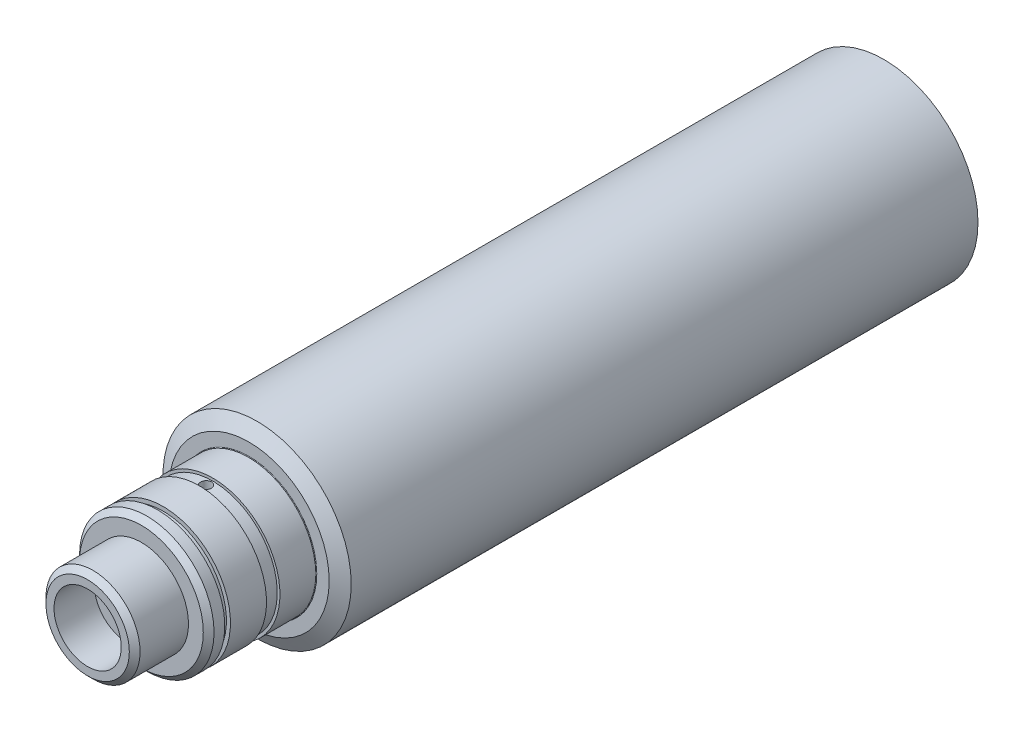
ISO-10303-21;
HEADER;
FILE_DESCRIPTION(('STEP AP214'),'2;1');
FILE_NAME('part.step','',(''),(''),'','','');
FILE_SCHEMA(('AUTOMOTIVE_DESIGN { 1 0 10303 214 1 1 1 1 }'));
ENDSEC;
DATA;
#1=APPLICATION_CONTEXT('core data for automotive mechanical design processes');
#2=APPLICATION_PROTOCOL_DEFINITION('international standard','automotive_design',2000,#1);
#3=PRODUCT_CONTEXT('',#1,'mechanical');
#4=PRODUCT('Part','Part','',(#3));
#5=PRODUCT_RELATED_PRODUCT_CATEGORY('part','',(#4));
#6=PRODUCT_DEFINITION_FORMATION('','',#4);
#7=PRODUCT_DEFINITION_CONTEXT('part definition',#1,'design');
#8=PRODUCT_DEFINITION('design','',#6,#7);
#9=PRODUCT_DEFINITION_SHAPE('','',#8);
#10=(LENGTH_UNIT() NAMED_UNIT(*) SI_UNIT(.MILLI.,.METRE.));
#11=(NAMED_UNIT(*) PLANE_ANGLE_UNIT() SI_UNIT($,.RADIAN.));
#12=(NAMED_UNIT(*) SI_UNIT($,.STERADIAN.) SOLID_ANGLE_UNIT());
#13=UNCERTAINTY_MEASURE_WITH_UNIT(LENGTH_MEASURE(1.E-05),#10,'distance_accuracy_value','');
#14=(GEOMETRIC_REPRESENTATION_CONTEXT(3) GLOBAL_UNCERTAINTY_ASSIGNED_CONTEXT((#13)) GLOBAL_UNIT_ASSIGNED_CONTEXT((#10,
#11,#12)) REPRESENTATION_CONTEXT('',''));
#15=CARTESIAN_POINT('',(0.,0.,0.));
#16=DIRECTION('',(0.,0.,1.));
#17=DIRECTION('',(1.,0.,0.));
#18=AXIS2_PLACEMENT_3D('',#15,#16,#17);
#19=CARTESIAN_POINT('',(-1.33226762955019E-12,24.9999999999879,276.));
#20=DIRECTION('',(0.,0.,1.));
#21=DIRECTION('',(1.,0.,0.));
#22=AXIS2_PLACEMENT_3D('',#19,#20,#21);
#23=PLANE('',#22);
#24=CARTESIAN_POINT('',(-4.44089209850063E-13,-5.32907051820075E-12,276.));
#25=DIRECTION('',(0.,0.,1.));
#26=DIRECTION('',(1.,0.,0.));
#27=AXIS2_PLACEMENT_3D('',#24,#25,#26);
#28=CIRCLE('',#27,23.);
#29=CARTESIAN_POINT('',(22.9999999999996,-5.3303472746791E-12,276.));
#30=VERTEX_POINT('',#29);
#31=EDGE_CURVE('E440',#30,#30,#28,.T.);
#32=ORIENTED_EDGE('',*,*,#31,.T.);
#33=EDGE_LOOP('',(#32));
#34=FACE_BOUND('',#33,.T.);
#35=CARTESIAN_POINT('',(-4.44089209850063E-13,-5.32907051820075E-12,276.));
#36=DIRECTION('',(0.,0.,1.));
#37=DIRECTION('',(1.,0.,0.));
#38=AXIS2_PLACEMENT_3D('',#35,#36,#37);
#39=CIRCLE('',#38,17.5);
#40=CARTESIAN_POINT('',(17.4999999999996,-5.33004196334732E-12,276.));
#41=VERTEX_POINT('',#40);
#42=EDGE_CURVE('E523',#41,#41,#39,.T.);
#43=ORIENTED_EDGE('',*,*,#42,.F.);
#44=EDGE_LOOP('',(#43));
#45=FACE_BOUND('',#44,.T.);
#46=ADVANCED_FACE('F420',(#34,#45),#23,.T.);
#47=CARTESIAN_POINT('',(-4.44089209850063E-13,-7.105427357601E-12,187.852900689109));
#48=DIRECTION('',(0.,0.,-1.));
#49=DIRECTION('',(-1.,0.,0.));
#50=AXIS2_PLACEMENT_3D('',#47,#48,#49);
#51=CYLINDRICAL_SURFACE('',#50,25.);
#52=CARTESIAN_POINT('',(8.88178419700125E-13,-4.44089209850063E-12,254.5));
#53=DIRECTION('',(0.,0.,-1.));
#54=DIRECTION('',(-1.,0.,0.));
#55=AXIS2_PLACEMENT_3D('',#52,#53,#54);
#56=CIRCLE('',#55,25.);
#57=CARTESIAN_POINT('',(-24.9999999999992,-4.43950431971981E-12,254.5));
#58=VERTEX_POINT('',#57);
#59=EDGE_CURVE('E448',#58,#58,#56,.T.);
#60=ORIENTED_EDGE('',*,*,#59,.F.);
#61=EDGE_LOOP('',(#60));
#62=FACE_BOUND('',#61,.T.);
#63=CARTESIAN_POINT('',(4.44089209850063E-13,-2.66453525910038E-12,267.9));
#64=DIRECTION('',(0.,0.,-1.));
#65=DIRECTION('',(-1.,0.,0.));
#66=AXIS2_PLACEMENT_3D('',#63,#64,#65);
#67=CIRCLE('',#66,25.);
#68=CARTESIAN_POINT('',(-24.9999999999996,-2.66314748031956E-12,267.9));
#69=VERTEX_POINT('',#68);
#70=EDGE_CURVE('E525',#69,#69,#67,.T.);
#71=ORIENTED_EDGE('',*,*,#70,.T.);
#72=EDGE_LOOP('',(#71));
#73=FACE_BOUND('',#72,.T.);
#74=ADVANCED_FACE('F511',(#62,#73),#51,.T.);
#75=CARTESIAN_POINT('',(0.,-7.105427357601E-12,236.));
#76=DIRECTION('',(0.,0.,-1.));
#77=DIRECTION('',(-1.,0.,0.));
#78=AXIS2_PLACEMENT_3D('',#75,#76,#77);
#79=CYLINDRICAL_SURFACE('',#78,35.);
#80=CARTESIAN_POINT('',(-1.77635683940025E-12,-7.105427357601E-12,233.));
#81=DIRECTION('',(0.,0.,1.));
#82=DIRECTION('',(1.,0.,0.));
#83=AXIS2_PLACEMENT_3D('',#80,#81,#82);
#84=CIRCLE('',#83,35.);
#85=CARTESIAN_POINT('',(34.9999999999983,-7.10737024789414E-12,233.));
#86=VERTEX_POINT('',#85);
#87=EDGE_CURVE('E559',#86,#86,#84,.F.);
#88=ORIENTED_EDGE('',*,*,#87,.T.);
#89=EDGE_LOOP('',(#88));
#90=FACE_BOUND('',#89,.T.);
#91=CARTESIAN_POINT('',(0.,0.,0.));
#92=DIRECTION('',(0.,0.,1.));
#93=DIRECTION('',(1.,0.,0.));
#94=AXIS2_PLACEMENT_3D('',#91,#92,#93);
#95=CIRCLE('',#94,35.);
#96=CARTESIAN_POINT('',(35.0000000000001,0.,0.));
#97=VERTEX_POINT('',#96);
#98=EDGE_CURVE('E553',#97,#97,#95,.T.);
#99=ORIENTED_EDGE('',*,*,#98,.T.);
#100=EDGE_LOOP('',(#99));
#101=FACE_BOUND('',#100,.T.);
#102=ADVANCED_FACE('F516',(#90,#101),#79,.T.);
#103=CARTESIAN_POINT('',(0.,-7.105427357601E-12,236.));
#104=DIRECTION('',(0.,0.,1.));
#105=DIRECTION('',(1.,0.,0.));
#106=AXIS2_PLACEMENT_3D('',#103,#104,#105);
#107=PLANE('',#106);
#108=CARTESIAN_POINT('',(0.,-7.105427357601E-12,236.));
#109=DIRECTION('',(0.,0.,1.));
#110=DIRECTION('',(1.,0.,0.));
#111=AXIS2_PLACEMENT_3D('',#108,#109,#110);
#112=CIRCLE('',#111,25.2);
#113=CARTESIAN_POINT('',(25.2,-7.10682623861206E-12,236.));
#114=VERTEX_POINT('',#113);
#115=EDGE_CURVE('E431',#114,#114,#112,.F.);
#116=ORIENTED_EDGE('',*,*,#115,.T.);
#117=EDGE_LOOP('',(#116));
#118=FACE_BOUND('',#117,.T.);
#119=CARTESIAN_POINT('',(0.,-7.105427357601E-12,236.));
#120=DIRECTION('',(0.,0.,1.));
#121=DIRECTION('',(1.,0.,0.));
#122=AXIS2_PLACEMENT_3D('',#119,#120,#121);
#123=CIRCLE('',#122,29.8038475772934);
#124=CARTESIAN_POINT('',(29.8038475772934,-7.10708180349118E-12,236.));
#125=VERTEX_POINT('',#124);
#126=EDGE_CURVE('E556',#125,#125,#123,.T.);
#127=ORIENTED_EDGE('',*,*,#126,.T.);
#128=EDGE_LOOP('',(#127));
#129=FACE_BOUND('',#128,.T.);
#130=ADVANCED_FACE('F605',(#118,#129),#107,.T.);
#131=CARTESIAN_POINT('',(0.,0.,0.));
#132=DIRECTION('',(0.,0.,1.));
#133=DIRECTION('',(1.,0.,0.));
#134=AXIS2_PLACEMENT_3D('',#131,#132,#133);
#135=PLANE('',#134);
#136=CARTESIAN_POINT('',(0.,0.,0.));
#137=DIRECTION('',(0.,0.,-1.));
#138=DIRECTION('',(-1.,0.,0.));
#139=AXIS2_PLACEMENT_3D('',#136,#137,#138);
#140=CIRCLE('',#139,3.39999999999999);
#141=CARTESIAN_POINT('',(-3.4,0.,0.));
#142=VERTEX_POINT('',#141);
#143=EDGE_CURVE('E473',#142,#142,#140,.T.);
#144=ORIENTED_EDGE('',*,*,#143,.F.);
#145=EDGE_LOOP('',(#144));
#146=FACE_BOUND('',#145,.T.);
#147=ORIENTED_EDGE('',*,*,#98,.F.);
#148=EDGE_LOOP('',(#147));
#149=FACE_BOUND('',#148,.T.);
#150=ADVANCED_FACE('F602',(#146,#149),#135,.F.);
#151=CARTESIAN_POINT('',(0.,-7.105427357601E-12,236.));
#152=DIRECTION('',(0.,0.,-1.));
#153=DIRECTION('',(-1.,0.,0.));
#154=AXIS2_PLACEMENT_3D('',#151,#152,#153);
#155=CONICAL_SURFACE('',#154,29.8038475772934,1.04719755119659);
#156=ORIENTED_EDGE('',*,*,#87,.F.);
#157=EDGE_LOOP('',(#156));
#158=FACE_BOUND('',#157,.T.);
#159=ORIENTED_EDGE('',*,*,#126,.F.);
#160=EDGE_LOOP('',(#159));
#161=FACE_BOUND('',#160,.T.);
#162=ADVANCED_FACE('F589',(#158,#161),#155,.T.);
#163=CARTESIAN_POINT('',(-4.44089209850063E-13,-7.105427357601E-12,187.852900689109));
#164=DIRECTION('',(0.,0.,-1.));
#165=DIRECTION('',(-1.,0.,0.));
#166=AXIS2_PLACEMENT_3D('',#163,#164,#165);
#167=CYLINDRICAL_SURFACE('',#166,25.);
#168=CARTESIAN_POINT('',(0.,-7.105427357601E-12,236.2));
#169=DIRECTION('',(0.,0.,1.));
#170=DIRECTION('',(1.,0.,0.));
#171=AXIS2_PLACEMENT_3D('',#168,#169,#170);
#172=CIRCLE('',#171,25.);
#173=CARTESIAN_POINT('',(25.,-7.10681513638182E-12,236.2));
#174=VERTEX_POINT('',#173);
#175=EDGE_CURVE('E435',#174,#174,#172,.T.);
#176=ORIENTED_EDGE('',*,*,#175,.T.);
#177=EDGE_LOOP('',(#176));
#178=FACE_BOUND('',#177,.T.);
#179=CARTESIAN_POINT('',(4.44089209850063E-13,-3.5527136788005E-12,249.5));
#180=DIRECTION('',(0.,0.,-1.));
#181=DIRECTION('',(-1.,0.,0.));
#182=AXIS2_PLACEMENT_3D('',#179,#180,#181);
#183=CIRCLE('',#182,25.);
#184=CARTESIAN_POINT('',(-24.9999999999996,-3.55132590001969E-12,249.5));
#185=VERTEX_POINT('',#184);
#186=EDGE_CURVE('E550',#185,#185,#183,.T.);
#187=ORIENTED_EDGE('',*,*,#186,.T.);
#188=EDGE_LOOP('',(#187));
#189=FACE_BOUND('',#188,.T.);
#190=ADVANCED_FACE('F585',(#178,#189),#167,.T.);
#191=CARTESIAN_POINT('',(-4.44089209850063E-13,24.9999999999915,249.5));
#192=DIRECTION('',(0.,0.,1.));
#193=DIRECTION('',(1.,0.,0.));
#194=AXIS2_PLACEMENT_3D('',#191,#192,#193);
#195=PLANE('',#194);
#196=CARTESIAN_POINT('',(4.44089209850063E-13,-3.5527136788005E-12,249.5));
#197=DIRECTION('',(0.,0.,-1.));
#198=DIRECTION('',(-1.,0.,0.));
#199=AXIS2_PLACEMENT_3D('',#196,#197,#198);
#200=CIRCLE('',#199,24.);
#201=CARTESIAN_POINT('',(-23.9999999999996,-3.55138141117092E-12,249.5));
#202=VERTEX_POINT('',#201);
#203=EDGE_CURVE('E547',#202,#202,#200,.T.);
#204=ORIENTED_EDGE('',*,*,#203,.T.);
#205=EDGE_LOOP('',(#204));
#206=FACE_BOUND('',#205,.T.);
#207=ORIENTED_EDGE('',*,*,#186,.F.);
#208=EDGE_LOOP('',(#207));
#209=FACE_BOUND('',#208,.T.);
#210=ADVANCED_FACE('F588',(#206,#209),#195,.T.);
#211=CARTESIAN_POINT('',(-4.44089209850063E-13,-7.105427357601E-12,187.852900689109));
#212=DIRECTION('',(0.,0.,-1.));
#213=DIRECTION('',(-1.,0.,0.));
#214=AXIS2_PLACEMENT_3D('',#211,#212,#213);
#215=CYLINDRICAL_SURFACE('',#214,24.);
#216=CARTESIAN_POINT('',(-1.33226762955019E-12,23.9999999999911,254.));
#217=CARTESIAN_POINT('',(0.112132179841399,23.999998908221,253.999995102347));
#218=CARTESIAN_POINT('',(0.224340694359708,23.999205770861,253.990538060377));
#219=CARTESIAN_POINT('',(0.445653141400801,23.9961180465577,253.95295129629));
#220=CARTESIAN_POINT('',(0.55475341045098,23.9938217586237,253.92480041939));
#221=CARTESIAN_POINT('',(0.766612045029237,23.9879872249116,253.850645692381));
#222=CARTESIAN_POINT('',(0.869373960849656,23.984449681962,253.804651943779));
#223=CARTESIAN_POINT('',(1.06569446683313,23.9765293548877,253.696135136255));
#224=CARTESIAN_POINT('',(1.15925501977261,23.9721467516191,253.633615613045));
#225=CARTESIAN_POINT('',(1.33477999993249,23.963015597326,253.493649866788));
#226=CARTESIAN_POINT('',(1.41671774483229,23.9582662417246,253.416170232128));
#227=CARTESIAN_POINT('',(1.56644226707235,23.9489436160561,253.248554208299));
#228=CARTESIAN_POINT('',(1.63422842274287,23.9443703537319,253.158417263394));
#229=CARTESIAN_POINT('',(1.75381584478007,23.9359090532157,252.967883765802));
#230=CARTESIAN_POINT('',(1.80559366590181,23.9320220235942,252.867472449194));
#231=CARTESIAN_POINT('',(1.89154486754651,23.925382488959,252.659343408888));
#232=CARTESIAN_POINT('',(1.92571855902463,23.9226299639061,252.551625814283));
#233=CARTESIAN_POINT('',(1.97541405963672,23.9185778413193,252.332209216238));
#234=CARTESIAN_POINT('',(1.99097933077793,23.9172748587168,252.220520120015));
#235=CARTESIAN_POINT('',(2.00315041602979,23.916258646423,251.996107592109));
#236=CARTESIAN_POINT('',(1.99975658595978,23.9165453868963,251.883384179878));
#237=CARTESIAN_POINT('',(1.97414172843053,23.9186731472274,251.660400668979));
#238=CARTESIAN_POINT('',(1.95196793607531,23.9205102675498,251.550135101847));
#239=CARTESIAN_POINT('',(1.88949597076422,23.9255256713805,251.334896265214));
#240=CARTESIAN_POINT('',(1.84919762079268,23.9287039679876,251.229923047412));
#241=CARTESIAN_POINT('',(1.75156757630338,23.9360480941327,251.028098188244));
#242=CARTESIAN_POINT('',(1.69421468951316,23.9402151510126,250.931256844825));
#243=CARTESIAN_POINT('',(1.5641188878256,23.9490661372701,250.748557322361));
#244=CARTESIAN_POINT('',(1.49137566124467,23.9537500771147,250.662699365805));
#245=CARTESIAN_POINT('',(1.33229916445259,23.9631244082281,250.504129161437));
#246=CARTESIAN_POINT('',(1.24592505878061,23.9678147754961,250.431457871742));
#247=CARTESIAN_POINT('',(1.06218111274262,23.9766598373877,250.301640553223));
#248=CARTESIAN_POINT('',(0.964811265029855,23.9808145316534,250.244494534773));
#249=CARTESIAN_POINT('',(0.761813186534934,23.988120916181,250.147352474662));
#250=CARTESIAN_POINT('',(0.656184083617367,23.991272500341,250.107358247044));
#251=CARTESIAN_POINT('',(0.439678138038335,23.9962163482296,250.045683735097));
#252=CARTESIAN_POINT('',(0.328801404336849,23.998008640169,250.02400307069));
#253=CARTESIAN_POINT('',(0.105302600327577,24.0000283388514,249.999622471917));
#254=CARTESIAN_POINT('',(-0.00731325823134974,24.000260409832,249.996865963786));
#255=CARTESIAN_POINT('',(-0.231405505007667,23.9991459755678,250.010263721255));
#256=CARTESIAN_POINT('',(-0.342881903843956,23.9977994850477,250.026417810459));
#257=CARTESIAN_POINT('',(-0.561369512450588,23.9936823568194,250.07713131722));
#258=CARTESIAN_POINT('',(-0.668386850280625,23.9909137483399,250.111664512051));
#259=CARTESIAN_POINT('',(-0.875108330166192,23.9842634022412,250.198129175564));
#260=CARTESIAN_POINT('',(-0.97481235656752,23.9803816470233,250.250060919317));
#261=CARTESIAN_POINT('',(-1.16433443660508,23.9719285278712,250.369990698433));
#262=CARTESIAN_POINT('',(-1.25412870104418,23.9673555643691,250.438026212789));
#263=CARTESIAN_POINT('',(-1.42104218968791,23.9580391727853,250.588178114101));
#264=CARTESIAN_POINT('',(-1.49816119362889,23.953295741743,250.670294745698));
#265=CARTESIAN_POINT('',(-1.63772909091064,23.9441592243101,250.846523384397));
#266=CARTESIAN_POINT('',(-1.70014106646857,23.9397670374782,250.940664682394));
#267=CARTESIAN_POINT('',(-1.80827012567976,23.9318430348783,251.138124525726));
#268=CARTESIAN_POINT('',(-1.85398737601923,23.9283112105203,251.24144297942));
#269=CARTESIAN_POINT('',(-1.92736635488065,23.9225128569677,251.454193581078));
#270=CARTESIAN_POINT('',(-1.95505068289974,23.9202447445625,251.563617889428));
#271=CARTESIAN_POINT('',(-1.9916515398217,23.9172253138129,251.785581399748));
#272=CARTESIAN_POINT('',(-2.00056842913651,23.9164739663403,251.898120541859));
#273=CARTESIAN_POINT('',(-1.99937712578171,23.916573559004,252.122752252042));
#274=CARTESIAN_POINT('',(-1.98932693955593,23.9174196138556,252.234845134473));
#275=CARTESIAN_POINT('',(-1.9506077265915,23.9206083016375,252.455745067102));
#276=CARTESIAN_POINT('',(-1.9219386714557,23.9229509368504,252.564552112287));
#277=CARTESIAN_POINT('',(-1.84681022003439,23.9288675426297,252.775795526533));
#278=CARTESIAN_POINT('',(-1.80035186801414,23.9324414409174,252.878232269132));
#279=CARTESIAN_POINT('',(-1.69097011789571,23.9404179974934,253.073861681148));
#280=CARTESIAN_POINT('',(-1.62804697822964,23.9448206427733,253.167054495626));
#281=CARTESIAN_POINT('',(-1.48730388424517,23.953974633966,253.341847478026));
#282=CARTESIAN_POINT('',(-1.40944098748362,23.958726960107,253.423413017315));
#283=CARTESIAN_POINT('',(-1.24110645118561,23.9680359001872,253.572350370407));
#284=CARTESIAN_POINT('',(-1.15063176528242,23.972592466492,253.639718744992));
#285=CARTESIAN_POINT('',(-0.959467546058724,23.9810046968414,253.758439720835));
#286=CARTESIAN_POINT('',(-0.858759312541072,23.9848590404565,253.809762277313));
#287=CARTESIAN_POINT('',(-0.650191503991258,23.9914170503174,253.894703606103));
#288=CARTESIAN_POINT('',(-0.542340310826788,23.9941220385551,253.928342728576));
#289=CARTESIAN_POINT('',(-0.361544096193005,23.9973821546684,253.968395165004));
#290=CARTESIAN_POINT('',(-0.289761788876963,23.9983593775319,253.980231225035));
#291=CARTESIAN_POINT('',(-0.145330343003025,23.9996686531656,253.996035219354));
#292=CARTESIAN_POINT('',(-0.0726812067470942,24.0000007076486,254.000003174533));
#293=CARTESIAN_POINT('',(-1.33226762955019E-12,23.9999999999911,254.));
#294=B_SPLINE_CURVE_WITH_KNOTS('',3,(#216,#217,#218,#219,#220,#221,#222,#223,#224,#225,#226,
#227,#228,#229,#230,#231,#232,#233,#234,#235,#236,#237,#238,#239,#240,#241,#242,#243,#244,#245,
#246,#247,#248,#249,#250,#251,#252,#253,#254,#255,#256,#257,#258,#259,#260,#261,#262,#263,#264,
#265,#266,#267,#268,#269,#270,#271,#272,#273,#274,#275,#276,#277,#278,#279,#280,#281,#282,#283,
#284,#285,#286,#287,#288,#289,#290,#291,#292,#293),.UNSPECIFIED.,.T.,.F.,(4,2,2,2,2,2,2,2,2,2,2,
2,2,2,2,2,2,2,2,2,2,2,2,2,2,2,2,2,2,2,2,2,2,2,2,2,2,2,4),(0.,0.336131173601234,
0.672643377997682,1.00896534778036,1.34521541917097,1.68222533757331,2.01925005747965,
2.35676605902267,2.69427609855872,3.03099629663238,3.36771017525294,3.70357966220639,
4.0394524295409,4.37574431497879,4.7120430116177,5.0493690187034,5.38669525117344,
5.72405715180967,6.0614120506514,6.3977579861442,6.73410078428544,7.06996498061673,
7.40583448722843,7.74249349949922,8.0791583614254,8.4166595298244,8.75415732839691,
9.09123134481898,9.42829888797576,9.76433725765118,10.1003761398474,10.4363952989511,
10.7724091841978,11.1094037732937,11.4464799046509,11.7841834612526,12.1214975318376,
12.3393697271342,12.5572413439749),.UNSPECIFIED.);
#295=CARTESIAN_POINT('',(-1.33226762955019E-12,23.9999999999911,254.));
#296=VERTEX_POINT('',#295);
#297=EDGE_CURVE('E441',#296,#296,#294,.T.);
#298=ORIENTED_EDGE('',*,*,#297,.F.);
#299=EDGE_LOOP('',(#298));
#300=FACE_BOUND('',#299,.T.);
#301=CARTESIAN_POINT('',(8.88178419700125E-13,-4.44089209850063E-12,254.5));
#302=DIRECTION('',(0.,0.,-1.));
#303=DIRECTION('',(-1.,0.,0.));
#304=AXIS2_PLACEMENT_3D('',#301,#302,#303);
#305=CIRCLE('',#304,24.);
#306=CARTESIAN_POINT('',(-23.9999999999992,-4.43955983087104E-12,254.5));
#307=VERTEX_POINT('',#306);
#308=EDGE_CURVE('E544',#307,#307,#305,.T.);
#309=ORIENTED_EDGE('',*,*,#308,.T.);
#310=EDGE_LOOP('',(#309));
#311=FACE_BOUND('',#310,.T.);
#312=ORIENTED_EDGE('',*,*,#203,.F.);
#313=EDGE_LOOP('',(#312));
#314=FACE_BOUND('',#313,.T.);
#315=ADVANCED_FACE('F451',(#300,#311,#314),#215,.T.);
#316=CARTESIAN_POINT('',(8.88178419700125E-13,23.9999999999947,254.5));
#317=DIRECTION('',(0.,0.,-1.));
#318=DIRECTION('',(-1.,0.,0.));
#319=AXIS2_PLACEMENT_3D('',#316,#317,#318);
#320=PLANE('',#319);
#321=ORIENTED_EDGE('',*,*,#59,.T.);
#322=EDGE_LOOP('',(#321));
#323=FACE_BOUND('',#322,.T.);
#324=ORIENTED_EDGE('',*,*,#308,.F.);
#325=EDGE_LOOP('',(#324));
#326=FACE_BOUND('',#325,.T.);
#327=ADVANCED_FACE('F461',(#323,#326),#320,.T.);
#328=CARTESIAN_POINT('',(-1.33226762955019E-12,34.9999999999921,252.));
#329=DIRECTION('',(0.,1.,0.));
#330=DIRECTION('',(0.,0.,1.));
#331=AXIS2_PLACEMENT_3D('',#328,#329,#330);
#332=CYLINDRICAL_SURFACE('',#331,1.99999999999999);
#333=CARTESIAN_POINT('',(0.,3.39999999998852,254.));
#334=CARTESIAN_POINT('',(-0.102624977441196,3.39999563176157,253.999995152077));
#335=CARTESIAN_POINT('',(-0.205435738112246,3.39530186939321,253.992044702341));
#336=CARTESIAN_POINT('',(-0.407989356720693,3.37697322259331,253.960639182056));
#337=CARTESIAN_POINT('',(-0.507723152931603,3.3633141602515,253.937142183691));
#338=CARTESIAN_POINT('',(-0.700745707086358,3.32844220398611,253.87594098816));
#339=CARTESIAN_POINT('',(-0.794063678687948,3.3072666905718,253.838307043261));
#340=CARTESIAN_POINT('',(-0.972779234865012,3.25918334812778,253.750323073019));
#341=CARTESIAN_POINT('',(-1.05817929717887,3.2322773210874,253.699977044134));
#342=CARTESIAN_POINT('',(-1.22586972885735,3.17265522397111,253.583797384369));
#343=CARTESIAN_POINT('',(-1.30744987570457,3.13965512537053,253.517087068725));
#344=CARTESIAN_POINT('',(-1.45895767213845,3.0721875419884,253.372028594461));
#345=CARTESIAN_POINT('',(-1.52887050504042,3.03771826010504,253.29366587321));
#346=CARTESIAN_POINT('',(-1.66332636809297,2.96644259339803,253.116734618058));
#347=CARTESIAN_POINT('',(-1.72628901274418,2.9298333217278,253.016875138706));
#348=CARTESIAN_POINT('',(-1.83428568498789,2.86346519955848,252.805844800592));
#349=CARTESIAN_POINT('',(-1.87934811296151,2.83369552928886,252.694692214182));
#350=CARTESIAN_POINT('',(-1.94107416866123,2.79164600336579,252.490703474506));
#351=CARTESIAN_POINT('',(-1.96190925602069,2.77690673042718,252.39963818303));
#352=CARTESIAN_POINT('',(-1.99065727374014,2.75637600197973,252.214542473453));
#353=CARTESIAN_POINT('',(-1.99858531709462,2.7505740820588,252.120515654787));
#354=CARTESIAN_POINT('',(-2.00106954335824,2.74876778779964,251.932029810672));
#355=CARTESIAN_POINT('',(-1.9956030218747,2.75278004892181,251.837570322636));
#356=CARTESIAN_POINT('',(-1.97158941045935,2.77002577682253,251.651172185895));
#357=CARTESIAN_POINT('',(-1.95303282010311,2.78326594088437,251.559235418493));
#358=CARTESIAN_POINT('',(-1.90401884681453,2.81701554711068,251.380975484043));
#359=CARTESIAN_POINT('',(-1.87366899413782,2.83745915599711,251.294609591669));
#360=CARTESIAN_POINT('',(-1.80215508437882,2.88340767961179,251.127950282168));
#361=CARTESIAN_POINT('',(-1.76098698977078,2.90891448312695,251.047659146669));
#362=CARTESIAN_POINT('',(-1.66098215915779,2.96732632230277,250.881023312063));
#363=CARTESIAN_POINT('',(-1.60033557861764,3.00075327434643,250.795946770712));
#364=CARTESIAN_POINT('',(-1.46670878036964,3.06828609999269,250.636322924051));
#365=CARTESIAN_POINT('',(-1.39371727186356,3.10239256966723,250.561785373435));
#366=CARTESIAN_POINT('',(-1.22629399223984,3.17261005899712,250.415679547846));
#367=CARTESIAN_POINT('',(-1.13031267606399,3.20841617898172,250.345721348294));
#368=CARTESIAN_POINT('',(-0.925766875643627,3.2732916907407,250.223165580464));
#369=CARTESIAN_POINT('',(-0.817209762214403,3.30236499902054,250.170557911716));
#370=CARTESIAN_POINT('',(-0.597859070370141,3.34877322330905,250.088099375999));
#371=CARTESIAN_POINT('',(-0.487686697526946,3.36675657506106,250.056975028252));
#372=CARTESIAN_POINT('',(-0.262474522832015,3.39173869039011,250.013997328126));
#373=CARTESIAN_POINT('',(-0.147440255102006,3.39874961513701,250.002122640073));
#374=CARTESIAN_POINT('',(0.0680320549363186,3.40080244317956,249.998638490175));
#375=CARTESIAN_POINT('',(0.168426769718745,3.39727968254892,250.004598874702));
#376=CARTESIAN_POINT('',(0.366524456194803,3.38164554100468,250.031334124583));
#377=CARTESIAN_POINT('',(0.464227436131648,3.36953418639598,250.052108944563));
#378=CARTESIAN_POINT('',(0.65257721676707,3.3381293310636,250.106960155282));
#379=CARTESIAN_POINT('',(0.743319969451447,3.3189703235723,250.140788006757));
#380=CARTESIAN_POINT('',(0.917856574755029,3.27500362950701,250.220463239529));
#381=CARTESIAN_POINT('',(1.00164893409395,3.25019473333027,250.266313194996));
#382=CARTESIAN_POINT('',(1.16933565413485,3.19394232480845,250.374085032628));
#383=CARTESIAN_POINT('',(1.25233009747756,3.16207678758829,250.437184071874));
#384=CARTESIAN_POINT('',(1.40719177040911,3.09627311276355,250.575016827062));
#385=CARTESIAN_POINT('',(1.4790458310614,3.0623325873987,250.649764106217));
#386=CARTESIAN_POINT('',(1.61862869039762,2.99113687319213,250.819509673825));
#387=CARTESIAN_POINT('',(1.68476854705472,2.95398618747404,250.915867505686));
#388=CARTESIAN_POINT('',(1.79987765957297,2.88529808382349,251.120146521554));
#389=CARTESIAN_POINT('',(1.84886727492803,2.85375403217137,251.22805379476));
#390=CARTESIAN_POINT('',(1.91898299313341,2.80693530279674,251.428827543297));
#391=CARTESIAN_POINT('',(1.94384155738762,2.78961831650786,251.519910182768));
#392=CARTESIAN_POINT('',(1.98050807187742,2.76371221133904,251.705828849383));
#393=CARTESIAN_POINT('',(1.99233281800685,2.75511186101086,251.800659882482));
#394=CARTESIAN_POINT('',(2.00227522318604,2.74789700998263,251.991718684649));
#395=CARTESIAN_POINT('',(2.00035201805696,2.74931227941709,252.087949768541));
#396=CARTESIAN_POINT('',(1.98282528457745,2.76197600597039,252.278517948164));
#397=CARTESIAN_POINT('',(1.96721361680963,2.77323031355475,252.372853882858));
#398=CARTESIAN_POINT('',(1.92396602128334,2.80339258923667,252.553823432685));
#399=CARTESIAN_POINT('',(1.89676576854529,2.82202165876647,252.640610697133));
#400=CARTESIAN_POINT('',(1.83150638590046,2.86480405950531,252.808522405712));
#401=CARTESIAN_POINT('',(1.79344317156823,2.88895946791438,252.889644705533));
#402=CARTESIAN_POINT('',(1.70075199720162,2.94462074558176,253.057350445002));
#403=CARTESIAN_POINT('',(1.64447161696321,2.97668562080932,253.142834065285));
#404=CARTESIAN_POINT('',(1.5198751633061,3.04219379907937,253.3039821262));
#405=CARTESIAN_POINT('',(1.45154946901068,3.07563818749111,253.379638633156));
#406=CARTESIAN_POINT('',(1.29293437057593,3.14593273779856,253.530349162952));
#407=CARTESIAN_POINT('',(1.20089294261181,3.18256150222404,253.603682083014));
#408=CARTESIAN_POINT('',(1.0038370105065,3.25010247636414,253.733856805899));
#409=CARTESIAN_POINT('',(0.898819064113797,3.2810131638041,253.790694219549));
#410=CARTESIAN_POINT('',(0.682920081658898,3.33246778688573,253.883286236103));
#411=CARTESIAN_POINT('',(0.572483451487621,3.35339936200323,253.919840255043));
#412=CARTESIAN_POINT('',(0.402565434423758,3.3765710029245,253.959933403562));
#413=CARTESIAN_POINT('',(0.345280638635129,3.38292145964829,253.970837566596));
#414=CARTESIAN_POINT('',(0.229749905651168,3.39272167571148,253.987614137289));
#415=CARTESIAN_POINT('',(0.171504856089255,3.39617397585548,253.993490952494));
#416=CARTESIAN_POINT('',(0.0942699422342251,3.39874524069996,253.997866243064));
#417=CARTESIAN_POINT('',(0.0754286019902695,3.39921533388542,253.998665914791));
#418=CARTESIAN_POINT('',(0.0377269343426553,3.39984311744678,253.999733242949));
#419=CARTESIAN_POINT('',(0.0188666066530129,3.40000080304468,254.000000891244));
#420=CARTESIAN_POINT('',(0.,3.39999999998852,254.));
#421=B_SPLINE_CURVE_WITH_KNOTS('',3,(#333,#334,#335,#336,#337,#338,#339,#340,#341,#342,#343,
#344,#345,#346,#347,#348,#349,#350,#351,#352,#353,#354,#355,#356,#357,#358,#359,#360,#361,#362,
#363,#364,#365,#366,#367,#368,#369,#370,#371,#372,#373,#374,#375,#376,#377,#378,#379,#380,#381,
#382,#383,#384,#385,#386,#387,#388,#389,#390,#391,#392,#393,#394,#395,#396,#397,#398,#399,#400,
#401,#402,#403,#404,#405,#406,#407,#408,#409,#410,#411,#412,#413,#414,#415,#416,#417,#418,#419,
#420),.UNSPECIFIED.,.T.,.F.,(4,2,2,2,2,2,2,2,2,2,2,2,2,2,2,2,2,2,2,2,2,2,2,2,2,2,2,2,2,2,2,2,2,
2,2,2,2,2,2,2,2,2,2,4),(0.,0.307797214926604,0.616427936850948,0.923544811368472,
1.23056525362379,1.56054697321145,1.89094460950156,2.25992393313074,2.62831547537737,
2.91082528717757,3.19300406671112,3.47566148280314,3.75852425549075,4.0388662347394,
4.31931299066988,4.64712883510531,4.97524614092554,5.34549300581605,5.71552395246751,
6.06111668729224,6.40632611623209,6.70673153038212,7.00713602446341,7.30208236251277,
7.5970919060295,7.92285433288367,8.24899895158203,8.61517633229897,8.98091752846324,
9.26768033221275,9.554073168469,9.84131762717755,10.1287330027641,10.4061830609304,
10.6837375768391,11.004275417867,11.3250704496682,11.6929897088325,12.0610067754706,
12.4132457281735,12.5889807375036,12.7645615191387,12.8211461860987,12.8777317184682),.UNSPECIFIED.);
#422=CARTESIAN_POINT('',(0.,3.39999999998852,254.));
#423=VERTEX_POINT('',#422);
#424=EDGE_CURVE('E467',#423,#423,#421,.T.);
#425=ORIENTED_EDGE('',*,*,#424,.T.);
#426=EDGE_LOOP('',(#425));
#427=FACE_BOUND('',#426,.T.);
#428=ORIENTED_EDGE('',*,*,#297,.T.);
#429=EDGE_LOOP('',(#428));
#430=FACE_BOUND('',#429,.T.);
#431=ADVANCED_FACE('F455',(#427,#430),#332,.F.);
#432=CARTESIAN_POINT('',(24.9999999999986,-3.5527136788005E-12,270.));
#433=DIRECTION('',(0.,0.,-1.));
#434=DIRECTION('',(-1.,0.,0.));
#435=AXIS2_PLACEMENT_3D('',#432,#433,#434);
#436=PLANE('',#435);
#437=CARTESIAN_POINT('',(-8.88178419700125E-13,-2.66453525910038E-12,270.));
#438=DIRECTION('',(0.,0.,-1.));
#439=DIRECTION('',(-1.,0.,0.));
#440=AXIS2_PLACEMENT_3D('',#437,#438,#439);
#441=CIRCLE('',#440,25.);
#442=CARTESIAN_POINT('',(-25.0000000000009,-2.66314748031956E-12,270.));
#443=VERTEX_POINT('',#442);
#444=EDGE_CURVE('E449',#443,#443,#441,.T.);
#445=ORIENTED_EDGE('',*,*,#444,.T.);
#446=EDGE_LOOP('',(#445));
#447=FACE_BOUND('',#446,.T.);
#448=CARTESIAN_POINT('',(-8.88178419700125E-13,-2.66453525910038E-12,270.));
#449=DIRECTION('',(0.,0.,-1.));
#450=DIRECTION('',(-1.,0.,0.));
#451=AXIS2_PLACEMENT_3D('',#448,#449,#450);
#452=CIRCLE('',#451,23.5);
#453=CARTESIAN_POINT('',(-23.5000000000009,-2.66323074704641E-12,270.));
#454=VERTEX_POINT('',#453);
#455=EDGE_CURVE('E538',#454,#454,#452,.T.);
#456=ORIENTED_EDGE('',*,*,#455,.F.);
#457=EDGE_LOOP('',(#456));
#458=FACE_BOUND('',#457,.T.);
#459=ADVANCED_FACE('F460',(#447,#458),#436,.T.);
#460=CARTESIAN_POINT('',(-4.44089209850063E-13,-7.105427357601E-12,187.852900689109));
#461=DIRECTION('',(0.,0.,-1.));
#462=DIRECTION('',(-1.,0.,0.));
#463=AXIS2_PLACEMENT_3D('',#460,#461,#462);
#464=CYLINDRICAL_SURFACE('',#463,23.5);
#465=ORIENTED_EDGE('',*,*,#455,.T.);
#466=EDGE_LOOP('',(#465));
#467=FACE_BOUND('',#466,.T.);
#468=CARTESIAN_POINT('',(4.44089209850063E-13,-2.66453525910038E-12,267.9));
#469=DIRECTION('',(0.,0.,-1.));
#470=DIRECTION('',(-1.,0.,0.));
#471=AXIS2_PLACEMENT_3D('',#468,#469,#470);
#472=CIRCLE('',#471,23.5);
#473=CARTESIAN_POINT('',(-23.4999999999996,-2.66323074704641E-12,267.9));
#474=VERTEX_POINT('',#473);
#475=EDGE_CURVE('E529',#474,#474,#472,.T.);
#476=ORIENTED_EDGE('',*,*,#475,.F.);
#477=EDGE_LOOP('',(#476));
#478=FACE_BOUND('',#477,.T.);
#479=ADVANCED_FACE('F500',(#467,#478),#464,.T.);
#480=CARTESIAN_POINT('',(24.9999999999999,-5.32907051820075E-12,267.9));
#481=DIRECTION('',(0.,0.,1.));
#482=DIRECTION('',(1.,0.,0.));
#483=AXIS2_PLACEMENT_3D('',#480,#481,#482);
#484=PLANE('',#483);
#485=ORIENTED_EDGE('',*,*,#475,.T.);
#486=EDGE_LOOP('',(#485));
#487=FACE_BOUND('',#486,.T.);
#488=ORIENTED_EDGE('',*,*,#70,.F.);
#489=EDGE_LOOP('',(#488));
#490=FACE_BOUND('',#489,.T.);
#491=ADVANCED_FACE('F497',(#487,#490),#484,.T.);
#492=CARTESIAN_POINT('',(4.44089209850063E-13,-7.105427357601E-12,274.));
#493=DIRECTION('',(0.,0.,-1.));
#494=DIRECTION('',(-1.,0.,0.));
#495=AXIS2_PLACEMENT_3D('',#492,#493,#494);
#496=CONICAL_SURFACE('',#495,25.,0.785398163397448);
#497=ORIENTED_EDGE('',*,*,#31,.F.);
#498=EDGE_LOOP('',(#497));
#499=FACE_BOUND('',#498,.T.);
#500=CARTESIAN_POINT('',(4.44089209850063E-13,-7.105427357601E-12,274.));
#501=DIRECTION('',(0.,0.,1.));
#502=DIRECTION('',(1.,0.,0.));
#503=AXIS2_PLACEMENT_3D('',#500,#501,#502);
#504=CIRCLE('',#503,25.);
#505=CARTESIAN_POINT('',(25.0000000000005,-7.10681513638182E-12,274.));
#506=VERTEX_POINT('',#505);
#507=EDGE_CURVE('E561',#506,#506,#504,.F.);
#508=ORIENTED_EDGE('',*,*,#507,.F.);
#509=EDGE_LOOP('',(#508));
#510=FACE_BOUND('',#509,.T.);
#511=ADVANCED_FACE('F499',(#499,#510),#496,.T.);
#512=ORIENTED_EDGE('',*,*,#507,.T.);
#513=EDGE_LOOP('',(#512));
#514=FACE_BOUND('',#513,.T.);
#515=ORIENTED_EDGE('',*,*,#444,.F.);
#516=EDGE_LOOP('',(#515));
#517=FACE_BOUND('',#516,.T.);
#518=ADVANCED_FACE('F496',(#514,#517),#51,.T.);
#519=CARTESIAN_POINT('',(-4.44089209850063E-13,-2.66453525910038E-12,296.));
#520=DIRECTION('',(0.,0.,-1.));
#521=DIRECTION('',(-1.,0.,0.));
#522=AXIS2_PLACEMENT_3D('',#519,#520,#521);
#523=CYLINDRICAL_SURFACE('',#522,17.5);
#524=CARTESIAN_POINT('',(8.88178419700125E-13,-3.5527136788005E-12,294.));
#525=DIRECTION('',(0.,0.,1.));
#526=DIRECTION('',(1.,0.,0.));
#527=AXIS2_PLACEMENT_3D('',#524,#525,#526);
#528=CIRCLE('',#527,17.5);
#529=CARTESIAN_POINT('',(17.5000000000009,-3.55368512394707E-12,294.));
#530=VERTEX_POINT('',#529);
#531=EDGE_CURVE('E11',#530,#530,#528,.F.);
#532=ORIENTED_EDGE('',*,*,#531,.T.);
#533=EDGE_LOOP('',(#532));
#534=FACE_BOUND('',#533,.T.);
#535=ORIENTED_EDGE('',*,*,#42,.T.);
#536=EDGE_LOOP('',(#535));
#537=FACE_BOUND('',#536,.T.);
#538=ADVANCED_FACE('F493',(#534,#537),#523,.T.);
#539=CARTESIAN_POINT('',(-4.44089209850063E-13,-2.66453525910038E-12,296.));
#540=DIRECTION('',(0.,0.,1.));
#541=DIRECTION('',(1.,0.,0.));
#542=AXIS2_PLACEMENT_3D('',#539,#540,#541);
#543=PLANE('',#542);
#544=CARTESIAN_POINT('',(-4.44089209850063E-13,-2.66453525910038E-12,296.));
#545=DIRECTION('',(0.,0.,1.));
#546=DIRECTION('',(1.,0.,0.));
#547=AXIS2_PLACEMENT_3D('',#544,#545,#546);
#548=CIRCLE('',#547,15.5);
#549=CARTESIAN_POINT('',(15.4999999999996,-2.66539568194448E-12,296.));
#550=VERTEX_POINT('',#549);
#551=EDGE_CURVE('E427',#550,#550,#548,.T.);
#552=ORIENTED_EDGE('',*,*,#551,.T.);
#553=EDGE_LOOP('',(#552));
#554=FACE_BOUND('',#553,.T.);
#555=CARTESIAN_POINT('',(-4.44089209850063E-13,-2.66453525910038E-12,296.));
#556=DIRECTION('',(0.,0.,1.));
#557=DIRECTION('',(1.,0.,0.));
#558=AXIS2_PLACEMENT_3D('',#555,#556,#557);
#559=CIRCLE('',#558,12.5);
#560=CARTESIAN_POINT('',(12.4999999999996,-2.66522914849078E-12,296.));
#561=VERTEX_POINT('',#560);
#562=EDGE_CURVE('E532',#561,#561,#559,.T.);
#563=ORIENTED_EDGE('',*,*,#562,.F.);
#564=EDGE_LOOP('',(#563));
#565=FACE_BOUND('',#564,.T.);
#566=ADVANCED_FACE('F489',(#554,#565),#543,.T.);
#567=CARTESIAN_POINT('',(0.,-6.21724893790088E-12,281.));
#568=DIRECTION('',(0.,0.,1.));
#569=DIRECTION('',(1.,0.,0.));
#570=AXIS2_PLACEMENT_3D('',#567,#568,#569);
#571=CYLINDRICAL_SURFACE('',#570,12.5);
#572=CARTESIAN_POINT('',(0.,-6.21724893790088E-12,281.));
#573=DIRECTION('',(0.,0.,1.));
#574=DIRECTION('',(1.,0.,0.));
#575=AXIS2_PLACEMENT_3D('',#572,#573,#574);
#576=CIRCLE('',#575,12.5);
#577=CARTESIAN_POINT('',(12.5,-6.21794282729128E-12,281.));
#578=VERTEX_POINT('',#577);
#579=EDGE_CURVE('E526',#578,#578,#576,.T.);
#580=ORIENTED_EDGE('',*,*,#579,.F.);
#581=EDGE_LOOP('',(#580));
#582=FACE_BOUND('',#581,.T.);
#583=ORIENTED_EDGE('',*,*,#562,.T.);
#584=EDGE_LOOP('',(#583));
#585=FACE_BOUND('',#584,.T.);
#586=ADVANCED_FACE('F485',(#582,#585),#571,.F.);
#587=CARTESIAN_POINT('',(0.,-6.21724893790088E-12,281.));
#588=DIRECTION('',(0.,0.,1.));
#589=DIRECTION('',(1.,0.,0.));
#590=AXIS2_PLACEMENT_3D('',#587,#588,#589);
#591=PLANE('',#590);
#592=CARTESIAN_POINT('',(0.,-6.21724893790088E-12,281.));
#593=DIRECTION('',(0.,0.,1.));
#594=DIRECTION('',(1.,0.,0.));
#595=AXIS2_PLACEMENT_3D('',#592,#593,#594);
#596=CIRCLE('',#595,3.39999999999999);
#597=CARTESIAN_POINT('',(3.4,-6.21743767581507E-12,281.));
#598=VERTEX_POINT('',#597);
#599=EDGE_CURVE('E768',#598,#598,#596,.T.);
#600=ORIENTED_EDGE('',*,*,#599,.F.);
#601=EDGE_LOOP('',(#600));
#602=FACE_BOUND('',#601,.T.);
#603=ORIENTED_EDGE('',*,*,#579,.T.);
#604=EDGE_LOOP('',(#603));
#605=FACE_BOUND('',#604,.T.);
#606=ADVANCED_FACE('F481',(#602,#605),#591,.T.);
#607=CARTESIAN_POINT('',(0.,-6.21724893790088E-12,281.));
#608=DIRECTION('',(0.,0.,1.));
#609=DIRECTION('',(1.,0.,0.));
#610=AXIS2_PLACEMENT_3D('',#607,#608,#609);
#611=CYLINDRICAL_SURFACE('',#610,3.39999999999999);
#612=ORIENTED_EDGE('',*,*,#599,.T.);
#613=EDGE_LOOP('',(#612));
#614=FACE_BOUND('',#613,.T.);
#615=ORIENTED_EDGE('',*,*,#143,.T.);
#616=EDGE_LOOP('',(#615));
#617=FACE_BOUND('',#616,.T.);
#618=ORIENTED_EDGE('',*,*,#424,.F.);
#619=EDGE_LOOP('',(#618));
#620=FACE_BOUND('',#619,.T.);
#621=ADVANCED_FACE('F477',(#614,#617,#620),#611,.F.);
#622=CARTESIAN_POINT('',(0.,-7.105427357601E-12,236.2));
#623=DIRECTION('',(0.,0.,1.));
#624=DIRECTION('',(1.,0.,0.));
#625=AXIS2_PLACEMENT_3D('',#622,#623,#624);
#626=TOROIDAL_SURFACE('',#625,25.2,0.2);
#627=ORIENTED_EDGE('',*,*,#115,.F.);
#628=EDGE_LOOP('',(#627));
#629=FACE_BOUND('',#628,.T.);
#630=ORIENTED_EDGE('',*,*,#175,.F.);
#631=EDGE_LOOP('',(#630));
#632=FACE_BOUND('',#631,.T.);
#633=ADVANCED_FACE('F480',(#629,#632),#626,.F.);
#634=CARTESIAN_POINT('',(-4.44089209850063E-13,-2.66453525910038E-12,296.));
#635=DIRECTION('',(0.,0.,-1.));
#636=DIRECTION('',(-1.,0.,0.));
#637=AXIS2_PLACEMENT_3D('',#634,#635,#636);
#638=CONICAL_SURFACE('',#637,15.5,0.785398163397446);
#639=ORIENTED_EDGE('',*,*,#531,.F.);
#640=EDGE_LOOP('',(#639));
#641=FACE_BOUND('',#640,.T.);
#642=ORIENTED_EDGE('',*,*,#551,.F.);
#643=EDGE_LOOP('',(#642));
#644=FACE_BOUND('',#643,.T.);
#645=ADVANCED_FACE('F422',(#641,#644),#638,.T.);
#646=CLOSED_SHELL('',(#46,#74,#102,#130,#150,#162,#190,#210,#315,#327,#431,#459,#479,#491,#511,
#518,#538,#566,#586,#606,#621,#633,#645));
#647=MANIFOLD_SOLID_BREP('B2',#646);
#648=ADVANCED_BREP_SHAPE_REPRESENTATION('',(#18,#647),#14);
#649=SHAPE_DEFINITION_REPRESENTATION(#9,#648);
ENDSEC;
END-ISO-10303-21;
